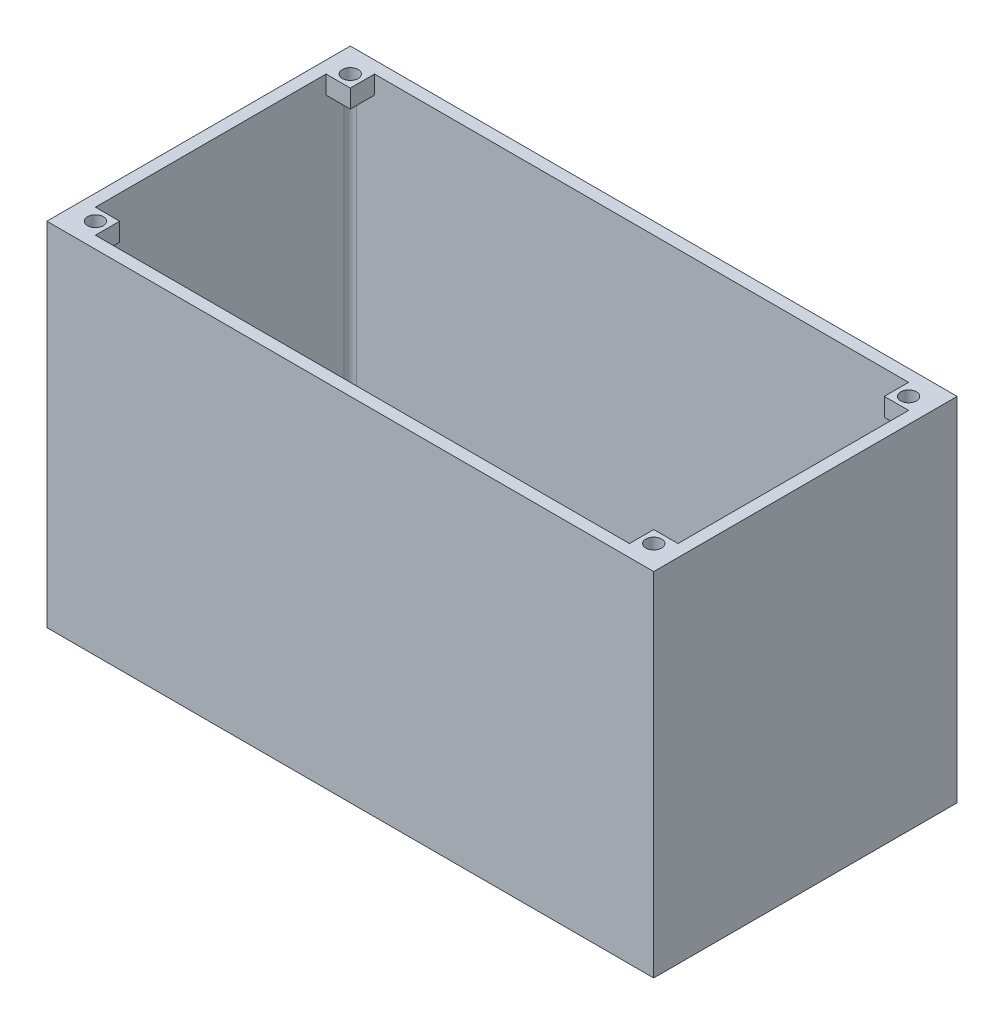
ISO-10303-21;
HEADER;
FILE_DESCRIPTION(('STEP AP214'),'2;1');
FILE_NAME('part.step','',(''),(''),'','','');
FILE_SCHEMA(('AUTOMOTIVE_DESIGN { 1 0 10303 214 1 1 1 1 }'));
ENDSEC;
DATA;
#1=APPLICATION_CONTEXT('core data for automotive mechanical design processes');
#2=APPLICATION_PROTOCOL_DEFINITION('international standard','automotive_design',2000,#1);
#3=PRODUCT_CONTEXT('',#1,'mechanical');
#4=PRODUCT('Part','Part','',(#3));
#5=PRODUCT_RELATED_PRODUCT_CATEGORY('part','',(#4));
#6=PRODUCT_DEFINITION_FORMATION('','',#4);
#7=PRODUCT_DEFINITION_CONTEXT('part definition',#1,'design');
#8=PRODUCT_DEFINITION('design','',#6,#7);
#9=PRODUCT_DEFINITION_SHAPE('','',#8);
#10=(LENGTH_UNIT() NAMED_UNIT(*) SI_UNIT(.MILLI.,.METRE.));
#11=(NAMED_UNIT(*) PLANE_ANGLE_UNIT() SI_UNIT($,.RADIAN.));
#12=(NAMED_UNIT(*) SI_UNIT($,.STERADIAN.) SOLID_ANGLE_UNIT());
#13=UNCERTAINTY_MEASURE_WITH_UNIT(LENGTH_MEASURE(1.E-05),#10,'distance_accuracy_value','');
#14=(GEOMETRIC_REPRESENTATION_CONTEXT(3) GLOBAL_UNCERTAINTY_ASSIGNED_CONTEXT((#13)) GLOBAL_UNIT_ASSIGNED_CONTEXT((#10,
#11,#12)) REPRESENTATION_CONTEXT('',''));
#15=CARTESIAN_POINT('',(0.,0.,0.));
#16=DIRECTION('',(0.,0.,1.));
#17=DIRECTION('',(1.,0.,0.));
#18=AXIS2_PLACEMENT_3D('',#15,#16,#17);
#19=CARTESIAN_POINT('',(0.,-2.53999999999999,-60.96));
#20=DIRECTION('',(0.,0.,-1.));
#21=DIRECTION('',(-1.,0.,0.));
#22=AXIS2_PLACEMENT_3D('',#19,#20,#21);
#23=PLANE('',#22);
#24=DIRECTION('',(0.,1.,0.));
#25=VECTOR('',#24,1.);
#26=CARTESIAN_POINT('',(7.62,-232.41,-60.96));
#27=LINE('',#26,#25);
#28=CARTESIAN_POINT('',(7.62,-232.41,-60.96));
#29=VERTEX_POINT('',#28);
#30=CARTESIAN_POINT('',(7.62,-228.6,-60.96));
#31=VERTEX_POINT('',#30);
#32=EDGE_CURVE('E240',#29,#31,#27,.T.);
#33=ORIENTED_EDGE('',*,*,#32,.F.);
#34=DIRECTION('',(1.,0.,0.));
#35=VECTOR('',#34,1.);
#36=CARTESIAN_POINT('',(0.,-232.41,-60.96));
#37=LINE('',#36,#35);
#38=CARTESIAN_POINT('',(3.81,-232.41,-60.96));
#39=VERTEX_POINT('',#38);
#40=EDGE_CURVE('E225',#39,#29,#37,.T.);
#41=ORIENTED_EDGE('',*,*,#40,.F.);
#42=DIRECTION('',(0.,-1.,0.));
#43=VECTOR('',#42,1.);
#44=CARTESIAN_POINT('',(3.81,-2.53999999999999,-60.96));
#45=LINE('',#44,#43);
#46=CARTESIAN_POINT('',(3.81,-302.26,-60.96));
#47=VERTEX_POINT('',#46);
#48=EDGE_CURVE('E452',#39,#47,#45,.T.);
#49=ORIENTED_EDGE('',*,*,#48,.T.);
#50=DIRECTION('',(1.,0.,0.));
#51=VECTOR('',#50,1.);
#52=CARTESIAN_POINT('',(0.,-302.26,-60.96));
#53=LINE('',#52,#51);
#54=CARTESIAN_POINT('',(123.19,-302.26,-60.96));
#55=VERTEX_POINT('',#54);
#56=EDGE_CURVE('E416',#47,#55,#53,.T.);
#57=ORIENTED_EDGE('',*,*,#56,.T.);
#58=DIRECTION('',(0.,-1.,0.));
#59=VECTOR('',#58,1.);
#60=CARTESIAN_POINT('',(123.19,-2.53999999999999,-60.96));
#61=LINE('',#60,#59);
#62=CARTESIAN_POINT('',(123.19,-232.41,-60.96));
#63=VERTEX_POINT('',#62);
#64=EDGE_CURVE('E72',#55,#63,#61,.F.);
#65=ORIENTED_EDGE('',*,*,#64,.T.);
#66=DIRECTION('',(1.,0.,0.));
#67=VECTOR('',#66,1.);
#68=CARTESIAN_POINT('',(0.,-232.41,-60.96));
#69=LINE('',#68,#67);
#70=CARTESIAN_POINT('',(119.38,-232.41,-60.96));
#71=VERTEX_POINT('',#70);
#72=EDGE_CURVE('E313',#71,#63,#69,.T.);
#73=ORIENTED_EDGE('',*,*,#72,.F.);
#74=DIRECTION('',(0.,1.,0.));
#75=VECTOR('',#74,1.);
#76=CARTESIAN_POINT('',(119.38,-232.41,-60.96));
#77=LINE('',#76,#75);
#78=CARTESIAN_POINT('',(119.38,-228.6,-60.96));
#79=VERTEX_POINT('',#78);
#80=EDGE_CURVE('E327',#71,#79,#77,.T.);
#81=ORIENTED_EDGE('',*,*,#80,.T.);
#82=DIRECTION('',(1.,0.,0.));
#83=VECTOR('',#82,1.);
#84=CARTESIAN_POINT('',(0.,-228.6,-60.96));
#85=LINE('',#84,#83);
#86=EDGE_CURVE('E248',#31,#79,#85,.T.);
#87=ORIENTED_EDGE('',*,*,#86,.F.);
#88=EDGE_LOOP('',(#33,#41,#49,#57,#65,#73,#81,#87));
#89=FACE_BOUND('',#88,.T.);
#90=ADVANCED_FACE('F63',(#89),#23,.F.);
#91=CARTESIAN_POINT('',(3.81,-2.53999999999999,-59.69));
#92=DIRECTION('',(0.,-1.,0.));
#93=DIRECTION('',(0.,0.,-1.));
#94=AXIS2_PLACEMENT_3D('',#91,#92,#93);
#95=CYLINDRICAL_SURFACE('',#94,1.27);
#96=CARTESIAN_POINT('',(3.81,-232.41,-59.69));
#97=DIRECTION('',(0.,1.,0.));
#98=DIRECTION('',(0.,0.,1.));
#99=AXIS2_PLACEMENT_3D('',#96,#97,#98);
#100=CIRCLE('',#99,1.27);
#101=CARTESIAN_POINT('',(2.54,-232.41,-59.69));
#102=VERTEX_POINT('',#101);
#103=EDGE_CURVE('E232',#102,#39,#100,.F.);
#104=ORIENTED_EDGE('',*,*,#103,.F.);
#105=DIRECTION('',(0.,-1.,0.));
#106=VECTOR('',#105,1.);
#107=CARTESIAN_POINT('',(2.54,-2.53999999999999,-59.69));
#108=LINE('',#107,#106);
#109=CARTESIAN_POINT('',(2.54,-302.26,-59.69));
#110=VERTEX_POINT('',#109);
#111=EDGE_CURVE('E466',#110,#102,#108,.F.);
#112=ORIENTED_EDGE('',*,*,#111,.F.);
#113=CARTESIAN_POINT('',(3.81,-302.26,-59.69));
#114=DIRECTION('',(0.,-1.,0.));
#115=DIRECTION('',(0.,0.,-1.));
#116=AXIS2_PLACEMENT_3D('',#113,#114,#115);
#117=CIRCLE('',#116,1.27);
#118=EDGE_CURVE('E470',#47,#110,#117,.F.);
#119=ORIENTED_EDGE('',*,*,#118,.F.);
#120=ORIENTED_EDGE('',*,*,#48,.F.);
#121=EDGE_LOOP('',(#104,#112,#119,#120));
#122=FACE_BOUND('',#121,.T.);
#123=ADVANCED_FACE('F553',(#122),#95,.F.);
#124=CARTESIAN_POINT('',(2.54,-2.53999999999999,0.));
#125=DIRECTION('',(1.,0.,0.));
#126=DIRECTION('',(0.,0.,-1.));
#127=AXIS2_PLACEMENT_3D('',#124,#125,#126);
#128=PLANE('',#127);
#129=DIRECTION('',(0.,1.,0.));
#130=VECTOR('',#129,1.);
#131=CARTESIAN_POINT('',(2.54,-232.41,-55.88));
#132=LINE('',#131,#130);
#133=CARTESIAN_POINT('',(2.54,-232.41,-55.88));
#134=VERTEX_POINT('',#133);
#135=CARTESIAN_POINT('',(2.54,-228.6,-55.88));
#136=VERTEX_POINT('',#135);
#137=EDGE_CURVE('E250',#134,#136,#132,.T.);
#138=ORIENTED_EDGE('',*,*,#137,.T.);
#139=DIRECTION('',(0.,0.,1.));
#140=VECTOR('',#139,1.);
#141=CARTESIAN_POINT('',(2.54,-228.6,0.));
#142=LINE('',#141,#140);
#143=CARTESIAN_POINT('',(2.54,-228.6,-7.62));
#144=VERTEX_POINT('',#143);
#145=EDGE_CURVE('E410',#136,#144,#142,.T.);
#146=ORIENTED_EDGE('',*,*,#145,.T.);
#147=DIRECTION('',(0.,1.,0.));
#148=VECTOR('',#147,1.);
#149=CARTESIAN_POINT('',(2.54,-232.41,-7.62));
#150=LINE('',#149,#148);
#151=CARTESIAN_POINT('',(2.54,-232.41,-7.62));
#152=VERTEX_POINT('',#151);
#153=EDGE_CURVE('E295',#152,#144,#150,.T.);
#154=ORIENTED_EDGE('',*,*,#153,.F.);
#155=DIRECTION('',(0.,0.,-1.));
#156=VECTOR('',#155,1.);
#157=CARTESIAN_POINT('',(2.54,-232.41,0.));
#158=LINE('',#157,#156);
#159=CARTESIAN_POINT('',(2.54,-232.41,-3.81));
#160=VERTEX_POINT('',#159);
#161=EDGE_CURVE('E275',#160,#152,#158,.T.);
#162=ORIENTED_EDGE('',*,*,#161,.F.);
#163=DIRECTION('',(0.,-1.,0.));
#164=VECTOR('',#163,1.);
#165=CARTESIAN_POINT('',(2.54,-302.26,-3.81));
#166=LINE('',#165,#164);
#167=CARTESIAN_POINT('',(2.54,-302.26,-3.81));
#168=VERTEX_POINT('',#167);
#169=EDGE_CURVE('E473',#160,#168,#166,.T.);
#170=ORIENTED_EDGE('',*,*,#169,.T.);
#171=DIRECTION('',(0.,0.,1.));
#172=VECTOR('',#171,1.);
#173=CARTESIAN_POINT('',(2.54,-302.26,0.));
#174=LINE('',#173,#172);
#175=EDGE_CURVE('E427',#110,#168,#174,.T.);
#176=ORIENTED_EDGE('',*,*,#175,.F.);
#177=ORIENTED_EDGE('',*,*,#111,.T.);
#178=DIRECTION('',(0.,0.,-1.));
#179=VECTOR('',#178,1.);
#180=CARTESIAN_POINT('',(2.54,-232.41,0.));
#181=LINE('',#180,#179);
#182=EDGE_CURVE('E257',#134,#102,#181,.T.);
#183=ORIENTED_EDGE('',*,*,#182,.F.);
#184=EDGE_LOOP('',(#138,#146,#154,#162,#170,#176,#177,#183));
#185=FACE_BOUND('',#184,.T.);
#186=ADVANCED_FACE('F545',(#185),#128,.T.);
#187=CARTESIAN_POINT('',(3.81,-2.53999999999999,-3.81));
#188=DIRECTION('',(0.,1.,0.));
#189=DIRECTION('',(0.,0.,1.));
#190=AXIS2_PLACEMENT_3D('',#187,#188,#189);
#191=CYLINDRICAL_SURFACE('',#190,1.27);
#192=CARTESIAN_POINT('',(3.81,-232.41,-3.81));
#193=DIRECTION('',(0.,1.,0.));
#194=DIRECTION('',(0.,0.,1.));
#195=AXIS2_PLACEMENT_3D('',#192,#193,#194);
#196=CIRCLE('',#195,1.27);
#197=CARTESIAN_POINT('',(3.81,-232.41,-2.54));
#198=VERTEX_POINT('',#197);
#199=EDGE_CURVE('E279',#198,#160,#196,.F.);
#200=ORIENTED_EDGE('',*,*,#199,.F.);
#201=DIRECTION('',(0.,-1.,0.));
#202=VECTOR('',#201,1.);
#203=CARTESIAN_POINT('',(3.81,-2.53999999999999,-2.54));
#204=LINE('',#203,#202);
#205=CARTESIAN_POINT('',(3.81,-302.26,-2.54));
#206=VERTEX_POINT('',#205);
#207=EDGE_CURVE('E476',#206,#198,#204,.F.);
#208=ORIENTED_EDGE('',*,*,#207,.F.);
#209=CARTESIAN_POINT('',(3.81,-302.26,-3.81));
#210=DIRECTION('',(0.,-1.,0.));
#211=DIRECTION('',(0.,0.,-1.));
#212=AXIS2_PLACEMENT_3D('',#209,#210,#211);
#213=CIRCLE('',#212,1.27);
#214=EDGE_CURVE('E479',#168,#206,#213,.F.);
#215=ORIENTED_EDGE('',*,*,#214,.F.);
#216=ORIENTED_EDGE('',*,*,#169,.F.);
#217=EDGE_LOOP('',(#200,#208,#215,#216));
#218=FACE_BOUND('',#217,.T.);
#219=ADVANCED_FACE('F574',(#218),#191,.F.);
#220=CARTESIAN_POINT('',(124.46,-2.53999999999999,0.));
#221=DIRECTION('',(1.,0.,0.));
#222=DIRECTION('',(0.,0.,-1.));
#223=AXIS2_PLACEMENT_3D('',#220,#221,#222);
#224=PLANE('',#223);
#225=DIRECTION('',(0.,1.,0.));
#226=VECTOR('',#225,1.);
#227=CARTESIAN_POINT('',(124.46,-232.41,-55.88));
#228=LINE('',#227,#226);
#229=CARTESIAN_POINT('',(124.46,-232.41,-55.88));
#230=VERTEX_POINT('',#229);
#231=CARTESIAN_POINT('',(124.46,-228.6,-55.88));
#232=VERTEX_POINT('',#231);
#233=EDGE_CURVE('E338',#230,#232,#228,.T.);
#234=ORIENTED_EDGE('',*,*,#233,.F.);
#235=DIRECTION('',(0.,0.,1.));
#236=VECTOR('',#235,1.);
#237=CARTESIAN_POINT('',(124.46,-232.41,0.));
#238=LINE('',#237,#236);
#239=CARTESIAN_POINT('',(124.46,-232.41,-59.69));
#240=VERTEX_POINT('',#239);
#241=EDGE_CURVE('E305',#240,#230,#238,.T.);
#242=ORIENTED_EDGE('',*,*,#241,.F.);
#243=DIRECTION('',(0.,-1.,0.));
#244=VECTOR('',#243,1.);
#245=CARTESIAN_POINT('',(124.46,-302.26,-59.69));
#246=LINE('',#245,#244);
#247=CARTESIAN_POINT('',(124.46,-302.26,-59.69));
#248=VERTEX_POINT('',#247);
#249=EDGE_CURVE('E493',#240,#248,#246,.T.);
#250=ORIENTED_EDGE('',*,*,#249,.T.);
#251=DIRECTION('',(0.,0.,1.));
#252=VECTOR('',#251,1.);
#253=CARTESIAN_POINT('',(124.46,-302.26,0.));
#254=LINE('',#253,#252);
#255=CARTESIAN_POINT('',(124.46,-302.26,-3.81));
#256=VERTEX_POINT('',#255);
#257=EDGE_CURVE('E420',#248,#256,#254,.T.);
#258=ORIENTED_EDGE('',*,*,#257,.T.);
#259=DIRECTION('',(0.,-1.,0.));
#260=VECTOR('',#259,1.);
#261=CARTESIAN_POINT('',(124.46,-2.53999999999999,-3.81));
#262=LINE('',#261,#260);
#263=CARTESIAN_POINT('',(124.46,-232.41,-3.81));
#264=VERTEX_POINT('',#263);
#265=EDGE_CURVE('E485',#256,#264,#262,.F.);
#266=ORIENTED_EDGE('',*,*,#265,.T.);
#267=DIRECTION('',(0.,0.,1.));
#268=VECTOR('',#267,1.);
#269=CARTESIAN_POINT('',(124.46,-232.41,0.));
#270=LINE('',#269,#268);
#271=CARTESIAN_POINT('',(124.46,-232.41,-7.62));
#272=VERTEX_POINT('',#271);
#273=EDGE_CURVE('E364',#272,#264,#270,.T.);
#274=ORIENTED_EDGE('',*,*,#273,.F.);
#275=DIRECTION('',(0.,1.,0.));
#276=VECTOR('',#275,1.);
#277=CARTESIAN_POINT('',(124.46,-232.41,-7.62));
#278=LINE('',#277,#276);
#279=CARTESIAN_POINT('',(124.46,-228.6,-7.62));
#280=VERTEX_POINT('',#279);
#281=EDGE_CURVE('E387',#272,#280,#278,.T.);
#282=ORIENTED_EDGE('',*,*,#281,.T.);
#283=DIRECTION('',(0.,0.,1.));
#284=VECTOR('',#283,1.);
#285=CARTESIAN_POINT('',(124.46,-228.6,0.));
#286=LINE('',#285,#284);
#287=EDGE_CURVE('E405',#232,#280,#286,.T.);
#288=ORIENTED_EDGE('',*,*,#287,.F.);
#289=EDGE_LOOP('',(#234,#242,#250,#258,#266,#274,#282,#288));
#290=FACE_BOUND('',#289,.T.);
#291=ADVANCED_FACE('F512',(#290),#224,.F.);
#292=CARTESIAN_POINT('',(123.19,-2.53999999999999,-59.69));
#293=DIRECTION('',(0.,1.,0.));
#294=DIRECTION('',(0.,0.,1.));
#295=AXIS2_PLACEMENT_3D('',#292,#293,#294);
#296=CYLINDRICAL_SURFACE('',#295,1.27);
#297=CARTESIAN_POINT('',(123.19,-232.41,-59.69));
#298=DIRECTION('',(0.,1.,0.));
#299=DIRECTION('',(0.,0.,1.));
#300=AXIS2_PLACEMENT_3D('',#297,#298,#299);
#301=CIRCLE('',#300,1.27);
#302=EDGE_CURVE('E309',#63,#240,#301,.F.);
#303=ORIENTED_EDGE('',*,*,#302,.F.);
#304=ORIENTED_EDGE('',*,*,#64,.F.);
#305=CARTESIAN_POINT('',(123.19,-302.26,-59.69));
#306=DIRECTION('',(0.,-1.,0.));
#307=DIRECTION('',(0.,0.,-1.));
#308=AXIS2_PLACEMENT_3D('',#305,#306,#307);
#309=CIRCLE('',#308,1.27);
#310=EDGE_CURVE('E12',#248,#55,#309,.F.);
#311=ORIENTED_EDGE('',*,*,#310,.F.);
#312=ORIENTED_EDGE('',*,*,#249,.F.);
#313=EDGE_LOOP('',(#303,#304,#311,#312));
#314=FACE_BOUND('',#313,.T.);
#315=ADVANCED_FACE('F65',(#314),#296,.F.);
#316=CARTESIAN_POINT('',(0.,-2.53999999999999,-2.54));
#317=DIRECTION('',(0.,0.,-1.));
#318=DIRECTION('',(-1.,0.,0.));
#319=AXIS2_PLACEMENT_3D('',#316,#317,#318);
#320=PLANE('',#319);
#321=DIRECTION('',(0.,1.,0.));
#322=VECTOR('',#321,1.);
#323=CARTESIAN_POINT('',(7.62,-232.41,-2.54));
#324=LINE('',#323,#322);
#325=CARTESIAN_POINT('',(7.62,-232.41,-2.54));
#326=VERTEX_POINT('',#325);
#327=CARTESIAN_POINT('',(7.62,-228.6,-2.54));
#328=VERTEX_POINT('',#327);
#329=EDGE_CURVE('E283',#326,#328,#324,.T.);
#330=ORIENTED_EDGE('',*,*,#329,.T.);
#331=DIRECTION('',(1.,0.,0.));
#332=VECTOR('',#331,1.);
#333=CARTESIAN_POINT('',(0.,-228.6,-2.54));
#334=LINE('',#333,#332);
#335=CARTESIAN_POINT('',(119.38,-228.6,-2.54));
#336=VERTEX_POINT('',#335);
#337=EDGE_CURVE('E413',#328,#336,#334,.T.);
#338=ORIENTED_EDGE('',*,*,#337,.T.);
#339=DIRECTION('',(0.,1.,0.));
#340=VECTOR('',#339,1.);
#341=CARTESIAN_POINT('',(119.38,-232.41,-2.54));
#342=LINE('',#341,#340);
#343=CARTESIAN_POINT('',(119.38,-232.41,-2.54));
#344=VERTEX_POINT('',#343);
#345=EDGE_CURVE('E372',#344,#336,#342,.T.);
#346=ORIENTED_EDGE('',*,*,#345,.F.);
#347=DIRECTION('',(-1.,0.,0.));
#348=VECTOR('',#347,1.);
#349=CARTESIAN_POINT('',(0.,-232.41,-2.54));
#350=LINE('',#349,#348);
#351=CARTESIAN_POINT('',(123.19,-232.41,-2.54));
#352=VERTEX_POINT('',#351);
#353=EDGE_CURVE('E356',#352,#344,#350,.T.);
#354=ORIENTED_EDGE('',*,*,#353,.F.);
#355=DIRECTION('',(0.,-1.,0.));
#356=VECTOR('',#355,1.);
#357=CARTESIAN_POINT('',(123.19,-2.53999999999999,-2.54));
#358=LINE('',#357,#356);
#359=CARTESIAN_POINT('',(123.19,-302.26,-2.54));
#360=VERTEX_POINT('',#359);
#361=EDGE_CURVE('E482',#352,#360,#358,.T.);
#362=ORIENTED_EDGE('',*,*,#361,.T.);
#363=DIRECTION('',(1.,0.,0.));
#364=VECTOR('',#363,1.);
#365=CARTESIAN_POINT('',(0.,-302.26,-2.54));
#366=LINE('',#365,#364);
#367=EDGE_CURVE('E423',#206,#360,#366,.T.);
#368=ORIENTED_EDGE('',*,*,#367,.F.);
#369=ORIENTED_EDGE('',*,*,#207,.T.);
#370=DIRECTION('',(-1.,0.,0.));
#371=VECTOR('',#370,1.);
#372=CARTESIAN_POINT('',(0.,-232.41,-2.54));
#373=LINE('',#372,#371);
#374=EDGE_CURVE('E87',#326,#198,#373,.T.);
#375=ORIENTED_EDGE('',*,*,#374,.F.);
#376=EDGE_LOOP('',(#330,#338,#346,#354,#362,#368,#369,#375));
#377=FACE_BOUND('',#376,.T.);
#378=ADVANCED_FACE('F570',(#377),#320,.T.);
#379=CARTESIAN_POINT('',(123.19,-2.53999999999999,-3.81));
#380=DIRECTION('',(0.,-1.,0.));
#381=DIRECTION('',(0.,0.,-1.));
#382=AXIS2_PLACEMENT_3D('',#379,#380,#381);
#383=CYLINDRICAL_SURFACE('',#382,1.27);
#384=CARTESIAN_POINT('',(123.19,-232.41,-3.81));
#385=DIRECTION('',(0.,1.,0.));
#386=DIRECTION('',(0.,0.,1.));
#387=AXIS2_PLACEMENT_3D('',#384,#385,#386);
#388=CIRCLE('',#387,1.27);
#389=EDGE_CURVE('E360',#264,#352,#388,.F.);
#390=ORIENTED_EDGE('',*,*,#389,.F.);
#391=ORIENTED_EDGE('',*,*,#265,.F.);
#392=CARTESIAN_POINT('',(123.19,-302.26,-3.81));
#393=DIRECTION('',(0.,-1.,0.));
#394=DIRECTION('',(0.,0.,-1.));
#395=AXIS2_PLACEMENT_3D('',#392,#393,#394);
#396=CIRCLE('',#395,1.27);
#397=EDGE_CURVE('E489',#360,#256,#396,.F.);
#398=ORIENTED_EDGE('',*,*,#397,.F.);
#399=ORIENTED_EDGE('',*,*,#361,.F.);
#400=EDGE_LOOP('',(#390,#391,#398,#399));
#401=FACE_BOUND('',#400,.T.);
#402=ADVANCED_FACE('F571',(#401),#383,.F.);
#403=CARTESIAN_POINT('',(0.,-302.26,0.));
#404=DIRECTION('',(-1.,0.,0.));
#405=DIRECTION('',(0.,0.,1.));
#406=AXIS2_PLACEMENT_3D('',#403,#404,#405);
#407=PLANE('',#406);
#408=DIRECTION('',(0.,1.,0.));
#409=VECTOR('',#408,1.);
#410=CARTESIAN_POINT('',(0.,-302.26,0.));
#411=LINE('',#410,#409);
#412=CARTESIAN_POINT('',(0.,-302.26,0.));
#413=VERTEX_POINT('',#412);
#414=CARTESIAN_POINT('',(0.,-228.6,0.));
#415=VERTEX_POINT('',#414);
#416=EDGE_CURVE('E447',#413,#415,#411,.T.);
#417=ORIENTED_EDGE('',*,*,#416,.T.);
#418=DIRECTION('',(0.,0.,1.));
#419=VECTOR('',#418,1.);
#420=CARTESIAN_POINT('',(0.,-228.6,-63.5));
#421=LINE('',#420,#419);
#422=CARTESIAN_POINT('',(0.,-228.6,-63.5));
#423=VERTEX_POINT('',#422);
#424=EDGE_CURVE('E386',#423,#415,#421,.T.);
#425=ORIENTED_EDGE('',*,*,#424,.F.);
#426=DIRECTION('',(0.,1.,0.));
#427=VECTOR('',#426,1.);
#428=CARTESIAN_POINT('',(0.,-302.26,-63.5));
#429=LINE('',#428,#427);
#430=CARTESIAN_POINT('',(0.,-302.26,-63.5));
#431=VERTEX_POINT('',#430);
#432=EDGE_CURVE('E448',#431,#423,#429,.T.);
#433=ORIENTED_EDGE('',*,*,#432,.F.);
#434=DIRECTION('',(0.,0.,1.));
#435=VECTOR('',#434,1.);
#436=CARTESIAN_POINT('',(0.,-302.26,0.));
#437=LINE('',#436,#435);
#438=EDGE_CURVE('E431',#431,#413,#437,.T.);
#439=ORIENTED_EDGE('',*,*,#438,.T.);
#440=EDGE_LOOP('',(#417,#425,#433,#439));
#441=FACE_BOUND('',#440,.T.);
#442=ADVANCED_FACE('F606',(#441),#407,.T.);
#443=CARTESIAN_POINT('',(0.,-302.26,-63.5));
#444=DIRECTION('',(0.,0.,-1.));
#445=DIRECTION('',(-1.,0.,0.));
#446=AXIS2_PLACEMENT_3D('',#443,#444,#445);
#447=PLANE('',#446);
#448=ORIENTED_EDGE('',*,*,#432,.T.);
#449=DIRECTION('',(-1.,0.,0.));
#450=VECTOR('',#449,1.);
#451=CARTESIAN_POINT('',(0.,-228.6,-63.5));
#452=LINE('',#451,#450);
#453=CARTESIAN_POINT('',(127.,-228.6,-63.5));
#454=VERTEX_POINT('',#453);
#455=EDGE_CURVE('E402',#454,#423,#452,.T.);
#456=ORIENTED_EDGE('',*,*,#455,.F.);
#457=DIRECTION('',(0.,1.,0.));
#458=VECTOR('',#457,1.);
#459=CARTESIAN_POINT('',(127.,-302.26,-63.5));
#460=LINE('',#459,#458);
#461=CARTESIAN_POINT('',(127.,-302.26,-63.5));
#462=VERTEX_POINT('',#461);
#463=EDGE_CURVE('E453',#462,#454,#460,.T.);
#464=ORIENTED_EDGE('',*,*,#463,.F.);
#465=DIRECTION('',(-1.,0.,0.));
#466=VECTOR('',#465,1.);
#467=CARTESIAN_POINT('',(0.,-302.26,-63.5));
#468=LINE('',#467,#466);
#469=EDGE_CURVE('E443',#462,#431,#468,.T.);
#470=ORIENTED_EDGE('',*,*,#469,.T.);
#471=EDGE_LOOP('',(#448,#456,#464,#470));
#472=FACE_BOUND('',#471,.T.);
#473=ADVANCED_FACE('F602',(#472),#447,.T.);
#474=CARTESIAN_POINT('',(127.,-302.26,0.));
#475=DIRECTION('',(1.,0.,0.));
#476=DIRECTION('',(0.,0.,-1.));
#477=AXIS2_PLACEMENT_3D('',#474,#475,#476);
#478=PLANE('',#477);
#479=ORIENTED_EDGE('',*,*,#463,.T.);
#480=DIRECTION('',(0.,0.,-1.));
#481=VECTOR('',#480,1.);
#482=CARTESIAN_POINT('',(127.,-228.6,-63.5));
#483=LINE('',#482,#481);
#484=CARTESIAN_POINT('',(127.,-228.6,0.));
#485=VERTEX_POINT('',#484);
#486=EDGE_CURVE('E399',#485,#454,#483,.T.);
#487=ORIENTED_EDGE('',*,*,#486,.F.);
#488=DIRECTION('',(0.,1.,0.));
#489=VECTOR('',#488,1.);
#490=CARTESIAN_POINT('',(127.,-302.26,0.));
#491=LINE('',#490,#489);
#492=CARTESIAN_POINT('',(127.,-302.26,0.));
#493=VERTEX_POINT('',#492);
#494=EDGE_CURVE('E457',#493,#485,#491,.T.);
#495=ORIENTED_EDGE('',*,*,#494,.F.);
#496=DIRECTION('',(0.,0.,-1.));
#497=VECTOR('',#496,1.);
#498=CARTESIAN_POINT('',(127.,-302.26,0.));
#499=LINE('',#498,#497);
#500=EDGE_CURVE('E439',#493,#462,#499,.T.);
#501=ORIENTED_EDGE('',*,*,#500,.T.);
#502=EDGE_LOOP('',(#479,#487,#495,#501));
#503=FACE_BOUND('',#502,.T.);
#504=ADVANCED_FACE('F605',(#503),#478,.T.);
#505=CARTESIAN_POINT('',(0.,-302.26,0.));
#506=DIRECTION('',(0.,0.,1.));
#507=DIRECTION('',(1.,0.,0.));
#508=AXIS2_PLACEMENT_3D('',#505,#506,#507);
#509=PLANE('',#508);
#510=ORIENTED_EDGE('',*,*,#494,.T.);
#511=DIRECTION('',(1.,0.,0.));
#512=VECTOR('',#511,1.);
#513=CARTESIAN_POINT('',(0.,-228.6,0.));
#514=LINE('',#513,#512);
#515=EDGE_CURVE('E396',#415,#485,#514,.T.);
#516=ORIENTED_EDGE('',*,*,#515,.F.);
#517=ORIENTED_EDGE('',*,*,#416,.F.);
#518=DIRECTION('',(1.,0.,0.));
#519=VECTOR('',#518,1.);
#520=CARTESIAN_POINT('',(0.,-302.26,0.));
#521=LINE('',#520,#519);
#522=EDGE_CURVE('E435',#413,#493,#521,.T.);
#523=ORIENTED_EDGE('',*,*,#522,.T.);
#524=EDGE_LOOP('',(#510,#516,#517,#523));
#525=FACE_BOUND('',#524,.T.);
#526=ADVANCED_FACE('F601',(#525),#509,.T.);
#527=CARTESIAN_POINT('',(0.,-302.26,0.));
#528=DIRECTION('',(0.,-1.,0.));
#529=DIRECTION('',(0.,0.,-1.));
#530=AXIS2_PLACEMENT_3D('',#527,#528,#529);
#531=PLANE('',#530);
#532=ORIENTED_EDGE('',*,*,#56,.F.);
#533=ORIENTED_EDGE('',*,*,#118,.T.);
#534=ORIENTED_EDGE('',*,*,#175,.T.);
#535=ORIENTED_EDGE('',*,*,#214,.T.);
#536=ORIENTED_EDGE('',*,*,#367,.T.);
#537=ORIENTED_EDGE('',*,*,#397,.T.);
#538=ORIENTED_EDGE('',*,*,#257,.F.);
#539=ORIENTED_EDGE('',*,*,#310,.T.);
#540=EDGE_LOOP('',(#532,#533,#534,#535,#536,#537,#538,#539));
#541=FACE_BOUND('',#540,.T.);
#542=ORIENTED_EDGE('',*,*,#438,.F.);
#543=ORIENTED_EDGE('',*,*,#469,.F.);
#544=ORIENTED_EDGE('',*,*,#500,.F.);
#545=ORIENTED_EDGE('',*,*,#522,.F.);
#546=EDGE_LOOP('',(#542,#543,#544,#545));
#547=FACE_BOUND('',#546,.T.);
#548=ADVANCED_FACE('F561',(#541,#547),#531,.T.);
#549=CARTESIAN_POINT('',(0.,-228.6,0.));
#550=DIRECTION('',(0.,1.,0.));
#551=DIRECTION('',(0.,0.,1.));
#552=AXIS2_PLACEMENT_3D('',#549,#550,#551);
#553=PLANE('',#552);
#554=ORIENTED_EDGE('',*,*,#145,.F.);
#555=DIRECTION('',(1.,0.,0.));
#556=VECTOR('',#555,1.);
#557=CARTESIAN_POINT('',(0.,-228.6,-55.88));
#558=LINE('',#557,#556);
#559=CARTESIAN_POINT('',(7.62,-228.6,-55.88));
#560=VERTEX_POINT('',#559);
#561=EDGE_CURVE('E543',#136,#560,#558,.T.);
#562=ORIENTED_EDGE('',*,*,#561,.T.);
#563=DIRECTION('',(0.,0.,1.));
#564=VECTOR('',#563,1.);
#565=CARTESIAN_POINT('',(7.62000000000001,-228.6,0.));
#566=LINE('',#565,#564);
#567=EDGE_CURVE('E79',#31,#560,#566,.T.);
#568=ORIENTED_EDGE('',*,*,#567,.F.);
#569=ORIENTED_EDGE('',*,*,#86,.T.);
#570=DIRECTION('',(0.,0.,1.));
#571=VECTOR('',#570,1.);
#572=CARTESIAN_POINT('',(119.38,-228.6,-3.2612801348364E-13));
#573=LINE('',#572,#571);
#574=CARTESIAN_POINT('',(119.38,-228.6,-55.88));
#575=VERTEX_POINT('',#574);
#576=EDGE_CURVE('E299',#79,#575,#573,.T.);
#577=ORIENTED_EDGE('',*,*,#576,.T.);
#578=DIRECTION('',(-1.,0.,0.));
#579=VECTOR('',#578,1.);
#580=CARTESIAN_POINT('',(0.,-228.6,-55.88));
#581=LINE('',#580,#579);
#582=EDGE_CURVE('E331',#232,#575,#581,.T.);
#583=ORIENTED_EDGE('',*,*,#582,.F.);
#584=ORIENTED_EDGE('',*,*,#287,.T.);
#585=DIRECTION('',(-1.,0.,0.));
#586=VECTOR('',#585,1.);
#587=CARTESIAN_POINT('',(0.,-228.6,-7.61999999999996));
#588=LINE('',#587,#586);
#589=CARTESIAN_POINT('',(119.38,-228.6,-7.62));
#590=VERTEX_POINT('',#589);
#591=EDGE_CURVE('E353',#280,#590,#588,.T.);
#592=ORIENTED_EDGE('',*,*,#591,.T.);
#593=DIRECTION('',(0.,0.,-1.));
#594=VECTOR('',#593,1.);
#595=CARTESIAN_POINT('',(119.38,-228.6,0.));
#596=LINE('',#595,#594);
#597=EDGE_CURVE('E376',#336,#590,#596,.T.);
#598=ORIENTED_EDGE('',*,*,#597,.F.);
#599=ORIENTED_EDGE('',*,*,#337,.F.);
#600=DIRECTION('',(0.,0.,-1.));
#601=VECTOR('',#600,1.);
#602=CARTESIAN_POINT('',(7.62,-228.6,0.));
#603=LINE('',#602,#601);
#604=CARTESIAN_POINT('',(7.62,-228.6,-7.62));
#605=VERTEX_POINT('',#604);
#606=EDGE_CURVE('E288',#328,#605,#603,.T.);
#607=ORIENTED_EDGE('',*,*,#606,.T.);
#608=DIRECTION('',(1.,0.,0.));
#609=VECTOR('',#608,1.);
#610=CARTESIAN_POINT('',(0.,-228.6,-7.62));
#611=LINE('',#610,#609);
#612=EDGE_CURVE('E265',#144,#605,#611,.T.);
#613=ORIENTED_EDGE('',*,*,#612,.F.);
#614=EDGE_LOOP('',(#554,#562,#568,#569,#577,#583,#584,#592,#598,#599,#607,#613));
#615=FACE_BOUND('',#614,.T.);
#616=ORIENTED_EDGE('',*,*,#424,.T.);
#617=ORIENTED_EDGE('',*,*,#515,.T.);
#618=ORIENTED_EDGE('',*,*,#486,.T.);
#619=ORIENTED_EDGE('',*,*,#455,.T.);
#620=EDGE_LOOP('',(#616,#617,#618,#619));
#621=FACE_BOUND('',#620,.T.);
#622=CARTESIAN_POINT('',(121.92,-228.6,-5.08));
#623=DIRECTION('',(0.,1.,0.));
#624=DIRECTION('',(0.,0.,1.));
#625=AXIS2_PLACEMENT_3D('',#622,#623,#624);
#626=CIRCLE('',#625,1.65100000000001);
#627=CARTESIAN_POINT('',(121.92,-228.6,-3.42899999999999));
#628=VERTEX_POINT('',#627);
#629=EDGE_CURVE('E342',#628,#628,#626,.T.);
#630=ORIENTED_EDGE('',*,*,#629,.F.);
#631=EDGE_LOOP('',(#630));
#632=FACE_BOUND('',#631,.T.);
#633=CARTESIAN_POINT('',(121.92,-228.6,-58.42));
#634=DIRECTION('',(0.,1.,0.));
#635=DIRECTION('',(0.,0.,1.));
#636=AXIS2_PLACEMENT_3D('',#633,#634,#635);
#637=CIRCLE('',#636,1.65100000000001);
#638=CARTESIAN_POINT('',(121.92,-228.6,-56.769));
#639=VERTEX_POINT('',#638);
#640=EDGE_CURVE('E310',#639,#639,#637,.T.);
#641=ORIENTED_EDGE('',*,*,#640,.F.);
#642=EDGE_LOOP('',(#641));
#643=FACE_BOUND('',#642,.T.);
#644=CARTESIAN_POINT('',(5.08,-228.6,-5.08));
#645=DIRECTION('',(0.,1.,0.));
#646=DIRECTION('',(0.,0.,1.));
#647=AXIS2_PLACEMENT_3D('',#644,#645,#646);
#648=CIRCLE('',#647,1.651);
#649=CARTESIAN_POINT('',(5.08,-228.6,-3.429));
#650=VERTEX_POINT('',#649);
#651=EDGE_CURVE('E284',#650,#650,#648,.T.);
#652=ORIENTED_EDGE('',*,*,#651,.F.);
#653=EDGE_LOOP('',(#652));
#654=FACE_BOUND('',#653,.T.);
#655=CARTESIAN_POINT('',(5.08,-228.6,-58.42));
#656=DIRECTION('',(0.,1.,0.));
#657=DIRECTION('',(0.,0.,1.));
#658=AXIS2_PLACEMENT_3D('',#655,#656,#657);
#659=CIRCLE('',#658,1.651);
#660=CARTESIAN_POINT('',(5.08,-228.6,-56.769));
#661=VERTEX_POINT('',#660);
#662=EDGE_CURVE('E931',#661,#661,#659,.T.);
#663=ORIENTED_EDGE('',*,*,#662,.F.);
#664=EDGE_LOOP('',(#663));
#665=FACE_BOUND('',#664,.T.);
#666=ADVANCED_FACE('F521',(#615,#621,#632,#643,#654,#665),#553,.T.);
#667=CARTESIAN_POINT('',(119.38,-232.41,0.));
#668=DIRECTION('',(1.,0.,0.));
#669=DIRECTION('',(0.,0.,-1.));
#670=AXIS2_PLACEMENT_3D('',#667,#668,#669);
#671=PLANE('',#670);
#672=ORIENTED_EDGE('',*,*,#597,.T.);
#673=DIRECTION('',(0.,1.,0.));
#674=VECTOR('',#673,1.);
#675=CARTESIAN_POINT('',(119.38,-232.41,-7.62));
#676=LINE('',#675,#674);
#677=CARTESIAN_POINT('',(119.38,-232.41,-7.62));
#678=VERTEX_POINT('',#677);
#679=EDGE_CURVE('E383',#678,#590,#676,.T.);
#680=ORIENTED_EDGE('',*,*,#679,.F.);
#681=DIRECTION('',(0.,0.,-1.));
#682=VECTOR('',#681,1.);
#683=CARTESIAN_POINT('',(119.38,-232.41,0.));
#684=LINE('',#683,#682);
#685=EDGE_CURVE('E352',#344,#678,#684,.T.);
#686=ORIENTED_EDGE('',*,*,#685,.F.);
#687=ORIENTED_EDGE('',*,*,#345,.T.);
#688=EDGE_LOOP('',(#672,#680,#686,#687));
#689=FACE_BOUND('',#688,.T.);
#690=ADVANCED_FACE('F532',(#689),#671,.F.);
#691=CARTESIAN_POINT('',(0.,-232.41,-7.61999999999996));
#692=DIRECTION('',(0.,0.,-1.));
#693=DIRECTION('',(-1.,0.,0.));
#694=AXIS2_PLACEMENT_3D('',#691,#692,#693);
#695=PLANE('',#694);
#696=ORIENTED_EDGE('',*,*,#591,.F.);
#697=ORIENTED_EDGE('',*,*,#281,.F.);
#698=DIRECTION('',(-1.,0.,0.));
#699=VECTOR('',#698,1.);
#700=CARTESIAN_POINT('',(0.,-232.41,-7.61999999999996));
#701=LINE('',#700,#699);
#702=EDGE_CURVE('E368',#272,#678,#701,.T.);
#703=ORIENTED_EDGE('',*,*,#702,.T.);
#704=ORIENTED_EDGE('',*,*,#679,.T.);
#705=EDGE_LOOP('',(#696,#697,#703,#704));
#706=FACE_BOUND('',#705,.T.);
#707=ADVANCED_FACE('F528',(#706),#695,.T.);
#708=CARTESIAN_POINT('',(121.92,-232.41,-5.08));
#709=DIRECTION('',(0.,1.,0.));
#710=DIRECTION('',(0.,0.,1.));
#711=AXIS2_PLACEMENT_3D('',#708,#709,#710);
#712=CYLINDRICAL_SURFACE('',#711,1.65100000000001);
#713=CARTESIAN_POINT('',(121.92,-232.41,-5.08));
#714=DIRECTION('',(0.,1.,0.));
#715=DIRECTION('',(0.,0.,1.));
#716=AXIS2_PLACEMENT_3D('',#713,#714,#715);
#717=CIRCLE('',#716,1.65100000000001);
#718=CARTESIAN_POINT('',(121.92,-232.41,-3.42899999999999));
#719=VERTEX_POINT('',#718);
#720=EDGE_CURVE('E348',#719,#719,#717,.T.);
#721=CARTESIAN_POINT('',(121.92,-232.41,-3.42899999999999));
#722=CARTESIAN_POINT('',(121.92,-232.3703125,-3.42899999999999));
#723=CARTESIAN_POINT('',(121.92,-232.330625,-3.42899999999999));
#724=CARTESIAN_POINT('',(121.92,-232.25125,-3.42899999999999));
#725=CARTESIAN_POINT('',(121.92,-232.2115625,-3.42899999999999));
#726=CARTESIAN_POINT('',(121.92,-232.1321875,-3.42899999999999));
#727=CARTESIAN_POINT('',(121.92,-232.0925,-3.42899999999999));
#728=CARTESIAN_POINT('',(121.92,-232.013125,-3.42899999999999));
#729=CARTESIAN_POINT('',(121.92,-231.9734375,-3.42899999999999));
#730=CARTESIAN_POINT('',(121.92,-231.8940625,-3.42899999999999));
#731=CARTESIAN_POINT('',(121.92,-231.854375,-3.42899999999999));
#732=CARTESIAN_POINT('',(121.92,-231.775,-3.42899999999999));
#733=CARTESIAN_POINT('',(121.92,-231.7353125,-3.42899999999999));
#734=CARTESIAN_POINT('',(121.92,-231.6559375,-3.42899999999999));
#735=CARTESIAN_POINT('',(121.92,-231.61625,-3.42899999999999));
#736=CARTESIAN_POINT('',(121.92,-231.536875,-3.42899999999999));
#737=CARTESIAN_POINT('',(121.92,-231.4971875,-3.42899999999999));
#738=CARTESIAN_POINT('',(121.92,-231.4178125,-3.42899999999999));
#739=CARTESIAN_POINT('',(121.92,-231.378125,-3.42899999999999));
#740=CARTESIAN_POINT('',(121.92,-231.29875,-3.42899999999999));
#741=CARTESIAN_POINT('',(121.92,-231.2590625,-3.42899999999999));
#742=CARTESIAN_POINT('',(121.92,-231.1796875,-3.42899999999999));
#743=CARTESIAN_POINT('',(121.92,-231.14,-3.42899999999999));
#744=CARTESIAN_POINT('',(121.92,-231.060625,-3.42899999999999));
#745=CARTESIAN_POINT('',(121.92,-231.0209375,-3.42899999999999));
#746=CARTESIAN_POINT('',(121.92,-230.9415625,-3.42899999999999));
#747=CARTESIAN_POINT('',(121.92,-230.901875,-3.42899999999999));
#748=CARTESIAN_POINT('',(121.92,-230.8225,-3.42899999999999));
#749=CARTESIAN_POINT('',(121.92,-230.7828125,-3.42899999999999));
#750=CARTESIAN_POINT('',(121.92,-230.7034375,-3.42899999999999));
#751=CARTESIAN_POINT('',(121.92,-230.66375,-3.42899999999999));
#752=CARTESIAN_POINT('',(121.92,-230.584375,-3.42899999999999));
#753=CARTESIAN_POINT('',(121.92,-230.5446875,-3.42899999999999));
#754=CARTESIAN_POINT('',(121.92,-230.4653125,-3.42899999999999));
#755=CARTESIAN_POINT('',(121.92,-230.425625,-3.42899999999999));
#756=CARTESIAN_POINT('',(121.92,-230.34625,-3.42899999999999));
#757=CARTESIAN_POINT('',(121.92,-230.3065625,-3.42899999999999));
#758=CARTESIAN_POINT('',(121.92,-230.2271875,-3.42899999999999));
#759=CARTESIAN_POINT('',(121.92,-230.1875,-3.42899999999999));
#760=CARTESIAN_POINT('',(121.92,-230.108125,-3.42899999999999));
#761=CARTESIAN_POINT('',(121.92,-230.0684375,-3.42899999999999));
#762=CARTESIAN_POINT('',(121.92,-229.9890625,-3.42899999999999));
#763=CARTESIAN_POINT('',(121.92,-229.949375,-3.42899999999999));
#764=CARTESIAN_POINT('',(121.92,-229.87,-3.42899999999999));
#765=CARTESIAN_POINT('',(121.92,-229.8303125,-3.42899999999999));
#766=CARTESIAN_POINT('',(121.92,-229.7509375,-3.42899999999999));
#767=CARTESIAN_POINT('',(121.92,-229.71125,-3.42899999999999));
#768=CARTESIAN_POINT('',(121.92,-229.631875,-3.42899999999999));
#769=CARTESIAN_POINT('',(121.92,-229.5921875,-3.42899999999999));
#770=CARTESIAN_POINT('',(121.92,-229.5128125,-3.42899999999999));
#771=CARTESIAN_POINT('',(121.92,-229.473125,-3.42899999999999));
#772=CARTESIAN_POINT('',(121.92,-229.39375,-3.42899999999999));
#773=CARTESIAN_POINT('',(121.92,-229.3540625,-3.42899999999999));
#774=CARTESIAN_POINT('',(121.92,-229.2746875,-3.42899999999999));
#775=CARTESIAN_POINT('',(121.92,-229.235,-3.42899999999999));
#776=CARTESIAN_POINT('',(121.92,-229.155625,-3.42899999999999));
#777=CARTESIAN_POINT('',(121.92,-229.1159375,-3.42899999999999));
#778=CARTESIAN_POINT('',(121.92,-229.0365625,-3.42899999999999));
#779=CARTESIAN_POINT('',(121.92,-228.996875,-3.42899999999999));
#780=CARTESIAN_POINT('',(121.92,-228.9175,-3.42899999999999));
#781=CARTESIAN_POINT('',(121.92,-228.8778125,-3.42899999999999));
#782=CARTESIAN_POINT('',(121.92,-228.7984375,-3.42899999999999));
#783=CARTESIAN_POINT('',(121.92,-228.75875,-3.42899999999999));
#784=CARTESIAN_POINT('',(121.92,-228.679375,-3.42899999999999));
#785=CARTESIAN_POINT('',(121.92,-228.6396875,-3.42899999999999));
#786=CARTESIAN_POINT('',(121.92,-228.6,-3.42899999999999));
#787=B_SPLINE_CURVE_WITH_KNOTS('',3,(#721,#722,#723,#724,#725,#726,#727,#728,#729,#730,#731,
#732,#733,#734,#735,#736,#737,#738,#739,#740,#741,#742,#743,#744,#745,#746,#747,#748,#749,#750,
#751,#752,#753,#754,#755,#756,#757,#758,#759,#760,#761,#762,#763,#764,#765,#766,#767,#768,#769,
#770,#771,#772,#773,#774,#775,#776,#777,#778,#779,#780,#781,#782,#783,#784,#785,#786),
.UNSPECIFIED.,.F.,.F.,(4,2,2,2,2,2,2,2,2,2,2,2,2,2,2,2,2,2,2,2,2,2,2,2,2,2,2,2,2,2,2,2,4),(0.,
0.119062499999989,0.238124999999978,0.357187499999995,0.476249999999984,0.5953125,
0.714374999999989,0.833437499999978,0.952499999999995,1.07156249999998,1.190625,
1.30968749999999,1.42874999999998,1.5478125,1.66687499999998,1.7859375,1.90499999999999,
2.02406249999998,2.143125,2.26218749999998,2.38125,2.50031249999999,2.61937499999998,2.7384375,
2.85749999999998,2.9765625,3.09562499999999,3.21468749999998,3.33375,3.45281249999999,3.571875,
3.69093749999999,3.81000000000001),.UNSPECIFIED.);
#788=EDGE_CURVE('BSEAM630',#719,#628,#787,.T.);
#789=ORIENTED_EDGE('',*,*,#720,.F.);
#790=ORIENTED_EDGE('',*,*,#629,.T.);
#791=ORIENTED_EDGE('',*,*,#788,.T.);
#792=ORIENTED_EDGE('',*,*,#788,.F.);
#793=EDGE_LOOP('',(#789,#791,#790,#792));
#794=FACE_BOUND('',#793,.T.);
#795=ADVANCED_FACE('F630',(#794),#712,.F.);
#796=CARTESIAN_POINT('',(0.,-232.41,0.));
#797=DIRECTION('',(0.,1.,0.));
#798=DIRECTION('',(0.,0.,1.));
#799=AXIS2_PLACEMENT_3D('',#796,#797,#798);
#800=PLANE('',#799);
#801=ORIENTED_EDGE('',*,*,#720,.T.);
#802=EDGE_LOOP('',(#801));
#803=FACE_BOUND('',#802,.T.);
#804=ORIENTED_EDGE('',*,*,#685,.T.);
#805=ORIENTED_EDGE('',*,*,#702,.F.);
#806=ORIENTED_EDGE('',*,*,#273,.T.);
#807=ORIENTED_EDGE('',*,*,#389,.T.);
#808=ORIENTED_EDGE('',*,*,#353,.T.);
#809=EDGE_LOOP('',(#804,#805,#806,#807,#808));
#810=FACE_BOUND('',#809,.T.);
#811=ADVANCED_FACE('F568',(#803,#810),#800,.F.);
#812=CARTESIAN_POINT('',(0.,-232.41,-55.88));
#813=DIRECTION('',(0.,0.,-1.));
#814=DIRECTION('',(-1.,0.,0.));
#815=AXIS2_PLACEMENT_3D('',#812,#813,#814);
#816=PLANE('',#815);
#817=ORIENTED_EDGE('',*,*,#582,.T.);
#818=DIRECTION('',(0.,1.,0.));
#819=VECTOR('',#818,1.);
#820=CARTESIAN_POINT('',(119.38,-232.41,-55.88));
#821=LINE('',#820,#819);
#822=CARTESIAN_POINT('',(119.38,-232.41,-55.88));
#823=VERTEX_POINT('',#822);
#824=EDGE_CURVE('E343',#823,#575,#821,.T.);
#825=ORIENTED_EDGE('',*,*,#824,.F.);
#826=DIRECTION('',(-1.,0.,0.));
#827=VECTOR('',#826,1.);
#828=CARTESIAN_POINT('',(0.,-232.41,-55.88));
#829=LINE('',#828,#827);
#830=EDGE_CURVE('E320',#230,#823,#829,.T.);
#831=ORIENTED_EDGE('',*,*,#830,.F.);
#832=ORIENTED_EDGE('',*,*,#233,.T.);
#833=EDGE_LOOP('',(#817,#825,#831,#832));
#834=FACE_BOUND('',#833,.T.);
#835=ADVANCED_FACE('F515',(#834),#816,.F.);
#836=CARTESIAN_POINT('',(119.38,-232.41,-3.2612801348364E-13));
#837=DIRECTION('',(-1.,0.,0.));
#838=DIRECTION('',(0.,0.,1.));
#839=AXIS2_PLACEMENT_3D('',#836,#837,#838);
#840=PLANE('',#839);
#841=ORIENTED_EDGE('',*,*,#576,.F.);
#842=ORIENTED_EDGE('',*,*,#80,.F.);
#843=DIRECTION('',(0.,0.,1.));
#844=VECTOR('',#843,1.);
#845=CARTESIAN_POINT('',(119.38,-232.41,-3.2612801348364E-13));
#846=LINE('',#845,#844);
#847=EDGE_CURVE('E316',#71,#823,#846,.T.);
#848=ORIENTED_EDGE('',*,*,#847,.T.);
#849=ORIENTED_EDGE('',*,*,#824,.T.);
#850=EDGE_LOOP('',(#841,#842,#848,#849));
#851=FACE_BOUND('',#850,.T.);
#852=ADVANCED_FACE('F519',(#851),#840,.T.);
#853=CARTESIAN_POINT('',(121.92,-232.41,-58.42));
#854=DIRECTION('',(0.,1.,0.));
#855=DIRECTION('',(0.,0.,1.));
#856=AXIS2_PLACEMENT_3D('',#853,#854,#855);
#857=CYLINDRICAL_SURFACE('',#856,1.65100000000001);
#858=CARTESIAN_POINT('',(121.92,-232.41,-58.42));
#859=DIRECTION('',(0.,1.,0.));
#860=DIRECTION('',(0.,0.,1.));
#861=AXIS2_PLACEMENT_3D('',#858,#859,#860);
#862=CIRCLE('',#861,1.65100000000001);
#863=CARTESIAN_POINT('',(121.92,-232.41,-56.769));
#864=VERTEX_POINT('',#863);
#865=EDGE_CURVE('E323',#864,#864,#862,.T.);
#866=CARTESIAN_POINT('',(121.92,-232.41,-56.769));
#867=CARTESIAN_POINT('',(121.92,-232.3703125,-56.769));
#868=CARTESIAN_POINT('',(121.92,-232.330625,-56.769));
#869=CARTESIAN_POINT('',(121.92,-232.25125,-56.769));
#870=CARTESIAN_POINT('',(121.92,-232.2115625,-56.769));
#871=CARTESIAN_POINT('',(121.92,-232.1321875,-56.769));
#872=CARTESIAN_POINT('',(121.92,-232.0925,-56.769));
#873=CARTESIAN_POINT('',(121.92,-232.013125,-56.769));
#874=CARTESIAN_POINT('',(121.92,-231.9734375,-56.769));
#875=CARTESIAN_POINT('',(121.92,-231.8940625,-56.769));
#876=CARTESIAN_POINT('',(121.92,-231.854375,-56.769));
#877=CARTESIAN_POINT('',(121.92,-231.775,-56.769));
#878=CARTESIAN_POINT('',(121.92,-231.7353125,-56.769));
#879=CARTESIAN_POINT('',(121.92,-231.6559375,-56.769));
#880=CARTESIAN_POINT('',(121.92,-231.61625,-56.769));
#881=CARTESIAN_POINT('',(121.92,-231.536875,-56.769));
#882=CARTESIAN_POINT('',(121.92,-231.4971875,-56.769));
#883=CARTESIAN_POINT('',(121.92,-231.4178125,-56.769));
#884=CARTESIAN_POINT('',(121.92,-231.378125,-56.769));
#885=CARTESIAN_POINT('',(121.92,-231.29875,-56.769));
#886=CARTESIAN_POINT('',(121.92,-231.2590625,-56.769));
#887=CARTESIAN_POINT('',(121.92,-231.1796875,-56.769));
#888=CARTESIAN_POINT('',(121.92,-231.14,-56.769));
#889=CARTESIAN_POINT('',(121.92,-231.060625,-56.769));
#890=CARTESIAN_POINT('',(121.92,-231.0209375,-56.769));
#891=CARTESIAN_POINT('',(121.92,-230.9415625,-56.769));
#892=CARTESIAN_POINT('',(121.92,-230.901875,-56.769));
#893=CARTESIAN_POINT('',(121.92,-230.8225,-56.769));
#894=CARTESIAN_POINT('',(121.92,-230.7828125,-56.769));
#895=CARTESIAN_POINT('',(121.92,-230.7034375,-56.769));
#896=CARTESIAN_POINT('',(121.92,-230.66375,-56.769));
#897=CARTESIAN_POINT('',(121.92,-230.584375,-56.769));
#898=CARTESIAN_POINT('',(121.92,-230.5446875,-56.769));
#899=CARTESIAN_POINT('',(121.92,-230.4653125,-56.769));
#900=CARTESIAN_POINT('',(121.92,-230.425625,-56.769));
#901=CARTESIAN_POINT('',(121.92,-230.34625,-56.769));
#902=CARTESIAN_POINT('',(121.92,-230.3065625,-56.769));
#903=CARTESIAN_POINT('',(121.92,-230.2271875,-56.769));
#904=CARTESIAN_POINT('',(121.92,-230.1875,-56.769));
#905=CARTESIAN_POINT('',(121.92,-230.108125,-56.769));
#906=CARTESIAN_POINT('',(121.92,-230.0684375,-56.769));
#907=CARTESIAN_POINT('',(121.92,-229.9890625,-56.769));
#908=CARTESIAN_POINT('',(121.92,-229.949375,-56.769));
#909=CARTESIAN_POINT('',(121.92,-229.87,-56.769));
#910=CARTESIAN_POINT('',(121.92,-229.8303125,-56.769));
#911=CARTESIAN_POINT('',(121.92,-229.7509375,-56.769));
#912=CARTESIAN_POINT('',(121.92,-229.71125,-56.769));
#913=CARTESIAN_POINT('',(121.92,-229.631875,-56.769));
#914=CARTESIAN_POINT('',(121.92,-229.5921875,-56.769));
#915=CARTESIAN_POINT('',(121.92,-229.5128125,-56.769));
#916=CARTESIAN_POINT('',(121.92,-229.473125,-56.769));
#917=CARTESIAN_POINT('',(121.92,-229.39375,-56.769));
#918=CARTESIAN_POINT('',(121.92,-229.3540625,-56.769));
#919=CARTESIAN_POINT('',(121.92,-229.2746875,-56.769));
#920=CARTESIAN_POINT('',(121.92,-229.235,-56.769));
#921=CARTESIAN_POINT('',(121.92,-229.155625,-56.769));
#922=CARTESIAN_POINT('',(121.92,-229.1159375,-56.769));
#923=CARTESIAN_POINT('',(121.92,-229.0365625,-56.769));
#924=CARTESIAN_POINT('',(121.92,-228.996875,-56.769));
#925=CARTESIAN_POINT('',(121.92,-228.9175,-56.769));
#926=CARTESIAN_POINT('',(121.92,-228.8778125,-56.769));
#927=CARTESIAN_POINT('',(121.92,-228.7984375,-56.769));
#928=CARTESIAN_POINT('',(121.92,-228.75875,-56.769));
#929=CARTESIAN_POINT('',(121.92,-228.679375,-56.769));
#930=CARTESIAN_POINT('',(121.92,-228.6396875,-56.769));
#931=CARTESIAN_POINT('',(121.92,-228.6,-56.769));
#932=B_SPLINE_CURVE_WITH_KNOTS('',3,(#866,#867,#868,#869,#870,#871,#872,#873,#874,#875,#876,
#877,#878,#879,#880,#881,#882,#883,#884,#885,#886,#887,#888,#889,#890,#891,#892,#893,#894,#895,
#896,#897,#898,#899,#900,#901,#902,#903,#904,#905,#906,#907,#908,#909,#910,#911,#912,#913,#914,
#915,#916,#917,#918,#919,#920,#921,#922,#923,#924,#925,#926,#927,#928,#929,#930,#931),
.UNSPECIFIED.,.F.,.F.,(4,2,2,2,2,2,2,2,2,2,2,2,2,2,2,2,2,2,2,2,2,2,2,2,2,2,2,2,2,2,2,2,4),(0.,
0.119062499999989,0.238124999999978,0.357187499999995,0.476249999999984,0.5953125,
0.714374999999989,0.833437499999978,0.952499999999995,1.07156249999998,1.190625,
1.30968749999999,1.42874999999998,1.5478125,1.66687499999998,1.7859375,1.90499999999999,
2.02406249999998,2.143125,2.26218749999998,2.38125,2.50031249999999,2.61937499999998,2.7384375,
2.85749999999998,2.9765625,3.09562499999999,3.21468749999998,3.33375,3.45281249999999,3.571875,
3.69093749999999,3.81000000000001),.UNSPECIFIED.);
#933=EDGE_CURVE('BSEAM643',#864,#639,#932,.T.);
#934=ORIENTED_EDGE('',*,*,#865,.F.);
#935=ORIENTED_EDGE('',*,*,#640,.T.);
#936=ORIENTED_EDGE('',*,*,#933,.T.);
#937=ORIENTED_EDGE('',*,*,#933,.F.);
#938=EDGE_LOOP('',(#934,#936,#935,#937));
#939=FACE_BOUND('',#938,.T.);
#940=ADVANCED_FACE('F643',(#939),#857,.F.);
#941=CARTESIAN_POINT('',(0.,-232.41,0.));
#942=DIRECTION('',(0.,1.,0.));
#943=DIRECTION('',(0.,0.,1.));
#944=AXIS2_PLACEMENT_3D('',#941,#942,#943);
#945=PLANE('',#944);
#946=ORIENTED_EDGE('',*,*,#241,.T.);
#947=ORIENTED_EDGE('',*,*,#830,.T.);
#948=ORIENTED_EDGE('',*,*,#847,.F.);
#949=ORIENTED_EDGE('',*,*,#72,.T.);
#950=ORIENTED_EDGE('',*,*,#302,.T.);
#951=EDGE_LOOP('',(#946,#947,#948,#949,#950));
#952=FACE_BOUND('',#951,.T.);
#953=ORIENTED_EDGE('',*,*,#865,.T.);
#954=EDGE_LOOP('',(#953));
#955=FACE_BOUND('',#954,.T.);
#956=ADVANCED_FACE('F507',(#952,#955),#945,.F.);
#957=CARTESIAN_POINT('',(0.,-232.41,-7.62));
#958=DIRECTION('',(0.,0.,1.));
#959=DIRECTION('',(1.,0.,0.));
#960=AXIS2_PLACEMENT_3D('',#957,#958,#959);
#961=PLANE('',#960);
#962=ORIENTED_EDGE('',*,*,#612,.T.);
#963=DIRECTION('',(0.,1.,0.));
#964=VECTOR('',#963,1.);
#965=CARTESIAN_POINT('',(7.62,-232.41,-7.62));
#966=LINE('',#965,#964);
#967=CARTESIAN_POINT('',(7.62,-232.41,-7.62));
#968=VERTEX_POINT('',#967);
#969=EDGE_CURVE('E300',#968,#605,#966,.T.);
#970=ORIENTED_EDGE('',*,*,#969,.F.);
#971=DIRECTION('',(1.,0.,0.));
#972=VECTOR('',#971,1.);
#973=CARTESIAN_POINT('',(0.,-232.41,-7.62));
#974=LINE('',#973,#972);
#975=EDGE_CURVE('E272',#152,#968,#974,.T.);
#976=ORIENTED_EDGE('',*,*,#975,.F.);
#977=ORIENTED_EDGE('',*,*,#153,.T.);
#978=EDGE_LOOP('',(#962,#970,#976,#977));
#979=FACE_BOUND('',#978,.T.);
#980=ADVANCED_FACE('F542',(#979),#961,.F.);
#981=CARTESIAN_POINT('',(5.08,-232.41,-5.08));
#982=DIRECTION('',(0.,1.,0.));
#983=DIRECTION('',(0.,0.,1.));
#984=AXIS2_PLACEMENT_3D('',#981,#982,#983);
#985=CYLINDRICAL_SURFACE('',#984,1.651);
#986=CARTESIAN_POINT('',(5.08,-232.41,-5.08));
#987=DIRECTION('',(0.,1.,0.));
#988=DIRECTION('',(0.,0.,1.));
#989=AXIS2_PLACEMENT_3D('',#986,#987,#988);
#990=CIRCLE('',#989,1.651);
#991=CARTESIAN_POINT('',(5.08,-232.41,-3.429));
#992=VERTEX_POINT('',#991);
#993=EDGE_CURVE('E261',#992,#992,#990,.T.);
#994=CARTESIAN_POINT('',(5.08,-232.41,-3.429));
#995=CARTESIAN_POINT('',(5.08,-232.3703125,-3.429));
#996=CARTESIAN_POINT('',(5.08,-232.330625,-3.429));
#997=CARTESIAN_POINT('',(5.08,-232.25125,-3.429));
#998=CARTESIAN_POINT('',(5.08,-232.2115625,-3.429));
#999=CARTESIAN_POINT('',(5.08,-232.1321875,-3.429));
#1000=CARTESIAN_POINT('',(5.08,-232.0925,-3.429));
#1001=CARTESIAN_POINT('',(5.08,-232.013125,-3.429));
#1002=CARTESIAN_POINT('',(5.08,-231.9734375,-3.429));
#1003=CARTESIAN_POINT('',(5.08,-231.8940625,-3.429));
#1004=CARTESIAN_POINT('',(5.08,-231.854375,-3.429));
#1005=CARTESIAN_POINT('',(5.08,-231.775,-3.429));
#1006=CARTESIAN_POINT('',(5.08,-231.7353125,-3.429));
#1007=CARTESIAN_POINT('',(5.08,-231.6559375,-3.429));
#1008=CARTESIAN_POINT('',(5.08,-231.61625,-3.429));
#1009=CARTESIAN_POINT('',(5.08,-231.536875,-3.429));
#1010=CARTESIAN_POINT('',(5.08,-231.4971875,-3.429));
#1011=CARTESIAN_POINT('',(5.08,-231.4178125,-3.429));
#1012=CARTESIAN_POINT('',(5.08,-231.378125,-3.429));
#1013=CARTESIAN_POINT('',(5.08,-231.29875,-3.429));
#1014=CARTESIAN_POINT('',(5.08,-231.2590625,-3.429));
#1015=CARTESIAN_POINT('',(5.08,-231.1796875,-3.429));
#1016=CARTESIAN_POINT('',(5.08,-231.14,-3.429));
#1017=CARTESIAN_POINT('',(5.08,-231.060625,-3.429));
#1018=CARTESIAN_POINT('',(5.08,-231.0209375,-3.429));
#1019=CARTESIAN_POINT('',(5.08,-230.9415625,-3.429));
#1020=CARTESIAN_POINT('',(5.08,-230.901875,-3.429));
#1021=CARTESIAN_POINT('',(5.08,-230.8225,-3.429));
#1022=CARTESIAN_POINT('',(5.08,-230.7828125,-3.429));
#1023=CARTESIAN_POINT('',(5.08,-230.7034375,-3.429));
#1024=CARTESIAN_POINT('',(5.08,-230.66375,-3.429));
#1025=CARTESIAN_POINT('',(5.08,-230.584375,-3.429));
#1026=CARTESIAN_POINT('',(5.08,-230.5446875,-3.429));
#1027=CARTESIAN_POINT('',(5.08,-230.4653125,-3.429));
#1028=CARTESIAN_POINT('',(5.08,-230.425625,-3.429));
#1029=CARTESIAN_POINT('',(5.08,-230.34625,-3.429));
#1030=CARTESIAN_POINT('',(5.08,-230.3065625,-3.429));
#1031=CARTESIAN_POINT('',(5.08,-230.2271875,-3.429));
#1032=CARTESIAN_POINT('',(5.08,-230.1875,-3.429));
#1033=CARTESIAN_POINT('',(5.08,-230.108125,-3.429));
#1034=CARTESIAN_POINT('',(5.08,-230.0684375,-3.429));
#1035=CARTESIAN_POINT('',(5.08,-229.9890625,-3.429));
#1036=CARTESIAN_POINT('',(5.08,-229.949375,-3.429));
#1037=CARTESIAN_POINT('',(5.08,-229.87,-3.429));
#1038=CARTESIAN_POINT('',(5.08,-229.8303125,-3.429));
#1039=CARTESIAN_POINT('',(5.08,-229.7509375,-3.429));
#1040=CARTESIAN_POINT('',(5.08,-229.71125,-3.429));
#1041=CARTESIAN_POINT('',(5.08,-229.631875,-3.429));
#1042=CARTESIAN_POINT('',(5.08,-229.5921875,-3.429));
#1043=CARTESIAN_POINT('',(5.08,-229.5128125,-3.429));
#1044=CARTESIAN_POINT('',(5.08,-229.473125,-3.429));
#1045=CARTESIAN_POINT('',(5.08,-229.39375,-3.429));
#1046=CARTESIAN_POINT('',(5.08,-229.3540625,-3.429));
#1047=CARTESIAN_POINT('',(5.08,-229.2746875,-3.429));
#1048=CARTESIAN_POINT('',(5.08,-229.235,-3.429));
#1049=CARTESIAN_POINT('',(5.08,-229.155625,-3.429));
#1050=CARTESIAN_POINT('',(5.08,-229.1159375,-3.429));
#1051=CARTESIAN_POINT('',(5.08,-229.0365625,-3.429));
#1052=CARTESIAN_POINT('',(5.08,-228.996875,-3.429));
#1053=CARTESIAN_POINT('',(5.08,-228.9175,-3.429));
#1054=CARTESIAN_POINT('',(5.08,-228.8778125,-3.429));
#1055=CARTESIAN_POINT('',(5.08,-228.7984375,-3.429));
#1056=CARTESIAN_POINT('',(5.08,-228.75875,-3.429));
#1057=CARTESIAN_POINT('',(5.08,-228.679375,-3.429));
#1058=CARTESIAN_POINT('',(5.08,-228.6396875,-3.429));
#1059=CARTESIAN_POINT('',(5.08,-228.6,-3.429));
#1060=B_SPLINE_CURVE_WITH_KNOTS('',3,(#994,#995,#996,#997,#998,#999,#1000,#1001,#1002,#1003,
#1004,#1005,#1006,#1007,#1008,#1009,#1010,#1011,#1012,#1013,#1014,#1015,#1016,#1017,#1018,#1019,
#1020,#1021,#1022,#1023,#1024,#1025,#1026,#1027,#1028,#1029,#1030,#1031,#1032,#1033,#1034,#1035,
#1036,#1037,#1038,#1039,#1040,#1041,#1042,#1043,#1044,#1045,#1046,#1047,#1048,#1049,#1050,#1051,
#1052,#1053,#1054,#1055,#1056,#1057,#1058,#1059),.UNSPECIFIED.,.F.,.F.,(4,2,2,2,2,2,2,2,2,2,2,2,
2,2,2,2,2,2,2,2,2,2,2,2,2,2,2,2,2,2,2,2,4),(0.,0.119062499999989,0.238124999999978,
0.357187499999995,0.476249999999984,0.5953125,0.714374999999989,0.833437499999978,
0.952499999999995,1.07156249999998,1.190625,1.30968749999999,1.42874999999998,1.5478125,
1.66687499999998,1.7859375,1.90499999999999,2.02406249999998,2.143125,2.26218749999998,2.38125,
2.50031249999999,2.61937499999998,2.7384375,2.85749999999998,2.9765625,3.09562499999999,
3.21468749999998,3.33375,3.45281249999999,3.571875,3.69093749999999,3.81000000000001),.UNSPECIFIED.);
#1061=EDGE_CURVE('BSEAM585',#992,#650,#1060,.T.);
#1062=ORIENTED_EDGE('',*,*,#993,.F.);
#1063=ORIENTED_EDGE('',*,*,#651,.T.);
#1064=ORIENTED_EDGE('',*,*,#1061,.T.);
#1065=ORIENTED_EDGE('',*,*,#1061,.F.);
#1066=EDGE_LOOP('',(#1062,#1064,#1063,#1065));
#1067=FACE_BOUND('',#1066,.T.);
#1068=ADVANCED_FACE('F585',(#1067),#985,.F.);
#1069=CARTESIAN_POINT('',(7.62,-232.41,0.));
#1070=DIRECTION('',(1.,0.,0.));
#1071=DIRECTION('',(0.,0.,-1.));
#1072=AXIS2_PLACEMENT_3D('',#1069,#1070,#1071);
#1073=PLANE('',#1072);
#1074=ORIENTED_EDGE('',*,*,#606,.F.);
#1075=ORIENTED_EDGE('',*,*,#329,.F.);
#1076=DIRECTION('',(0.,0.,-1.));
#1077=VECTOR('',#1076,1.);
#1078=CARTESIAN_POINT('',(7.62,-232.41,0.));
#1079=LINE('',#1078,#1077);
#1080=EDGE_CURVE('E268',#326,#968,#1079,.T.);
#1081=ORIENTED_EDGE('',*,*,#1080,.T.);
#1082=ORIENTED_EDGE('',*,*,#969,.T.);
#1083=EDGE_LOOP('',(#1074,#1075,#1081,#1082));
#1084=FACE_BOUND('',#1083,.T.);
#1085=ADVANCED_FACE('F537',(#1084),#1073,.T.);
#1086=CARTESIAN_POINT('',(0.,-232.41,0.));
#1087=DIRECTION('',(0.,1.,0.));
#1088=DIRECTION('',(0.,0.,1.));
#1089=AXIS2_PLACEMENT_3D('',#1086,#1087,#1088);
#1090=PLANE('',#1089);
#1091=ORIENTED_EDGE('',*,*,#993,.T.);
#1092=EDGE_LOOP('',(#1091));
#1093=FACE_BOUND('',#1092,.T.);
#1094=ORIENTED_EDGE('',*,*,#374,.T.);
#1095=ORIENTED_EDGE('',*,*,#199,.T.);
#1096=ORIENTED_EDGE('',*,*,#161,.T.);
#1097=ORIENTED_EDGE('',*,*,#975,.T.);
#1098=ORIENTED_EDGE('',*,*,#1080,.F.);
#1099=EDGE_LOOP('',(#1094,#1095,#1096,#1097,#1098));
#1100=FACE_BOUND('',#1099,.T.);
#1101=ADVANCED_FACE('F576',(#1093,#1100),#1090,.F.);
#1102=CARTESIAN_POINT('',(7.62000000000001,-232.41,0.));
#1103=DIRECTION('',(-1.,0.,0.));
#1104=DIRECTION('',(0.,0.,1.));
#1105=AXIS2_PLACEMENT_3D('',#1102,#1103,#1104);
#1106=PLANE('',#1105);
#1107=ORIENTED_EDGE('',*,*,#567,.T.);
#1108=DIRECTION('',(0.,1.,0.));
#1109=VECTOR('',#1108,1.);
#1110=CARTESIAN_POINT('',(7.62,-232.41,-55.88));
#1111=LINE('',#1110,#1109);
#1112=CARTESIAN_POINT('',(7.62,-232.41,-55.88));
#1113=VERTEX_POINT('',#1112);
#1114=EDGE_CURVE('E242',#1113,#560,#1111,.T.);
#1115=ORIENTED_EDGE('',*,*,#1114,.F.);
#1116=DIRECTION('',(0.,0.,1.));
#1117=VECTOR('',#1116,1.);
#1118=CARTESIAN_POINT('',(7.62000000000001,-232.41,0.));
#1119=LINE('',#1118,#1117);
#1120=EDGE_CURVE('E229',#29,#1113,#1119,.T.);
#1121=ORIENTED_EDGE('',*,*,#1120,.F.);
#1122=ORIENTED_EDGE('',*,*,#32,.T.);
#1123=EDGE_LOOP('',(#1107,#1115,#1121,#1122));
#1124=FACE_BOUND('',#1123,.T.);
#1125=ADVANCED_FACE('F239',(#1124),#1106,.F.);
#1126=CARTESIAN_POINT('',(0.,-232.41,-55.88));
#1127=DIRECTION('',(0.,0.,1.));
#1128=DIRECTION('',(1.,0.,0.));
#1129=AXIS2_PLACEMENT_3D('',#1126,#1127,#1128);
#1130=PLANE('',#1129);
#1131=ORIENTED_EDGE('',*,*,#561,.F.);
#1132=ORIENTED_EDGE('',*,*,#137,.F.);
#1133=DIRECTION('',(1.,0.,0.));
#1134=VECTOR('',#1133,1.);
#1135=CARTESIAN_POINT('',(0.,-232.41,-55.88));
#1136=LINE('',#1135,#1134);
#1137=EDGE_CURVE('E251',#134,#1113,#1136,.T.);
#1138=ORIENTED_EDGE('',*,*,#1137,.T.);
#1139=ORIENTED_EDGE('',*,*,#1114,.T.);
#1140=EDGE_LOOP('',(#1131,#1132,#1138,#1139));
#1141=FACE_BOUND('',#1140,.T.);
#1142=ADVANCED_FACE('F548',(#1141),#1130,.T.);
#1143=CARTESIAN_POINT('',(5.08,-232.41,-58.42));
#1144=DIRECTION('',(0.,1.,0.));
#1145=DIRECTION('',(0.,0.,1.));
#1146=AXIS2_PLACEMENT_3D('',#1143,#1144,#1145);
#1147=CYLINDRICAL_SURFACE('',#1146,1.651);
#1148=CARTESIAN_POINT('',(5.08,-232.41,-58.42));
#1149=DIRECTION('',(0.,1.,0.));
#1150=DIRECTION('',(0.,0.,1.));
#1151=AXIS2_PLACEMENT_3D('',#1148,#1149,#1150);
#1152=CIRCLE('',#1151,1.651);
#1153=CARTESIAN_POINT('',(5.08,-232.41,-56.769));
#1154=VERTEX_POINT('',#1153);
#1155=EDGE_CURVE('E245',#1154,#1154,#1152,.T.);
#1156=CARTESIAN_POINT('',(5.08,-232.41,-56.769));
#1157=CARTESIAN_POINT('',(5.08,-232.3703125,-56.769));
#1158=CARTESIAN_POINT('',(5.08,-232.330625,-56.769));
#1159=CARTESIAN_POINT('',(5.08,-232.25125,-56.769));
#1160=CARTESIAN_POINT('',(5.08,-232.2115625,-56.769));
#1161=CARTESIAN_POINT('',(5.08,-232.1321875,-56.769));
#1162=CARTESIAN_POINT('',(5.08,-232.0925,-56.769));
#1163=CARTESIAN_POINT('',(5.08,-232.013125,-56.769));
#1164=CARTESIAN_POINT('',(5.08,-231.9734375,-56.769));
#1165=CARTESIAN_POINT('',(5.08,-231.8940625,-56.769));
#1166=CARTESIAN_POINT('',(5.08,-231.854375,-56.769));
#1167=CARTESIAN_POINT('',(5.08,-231.775,-56.769));
#1168=CARTESIAN_POINT('',(5.08,-231.7353125,-56.769));
#1169=CARTESIAN_POINT('',(5.08,-231.6559375,-56.769));
#1170=CARTESIAN_POINT('',(5.08,-231.61625,-56.769));
#1171=CARTESIAN_POINT('',(5.08,-231.536875,-56.769));
#1172=CARTESIAN_POINT('',(5.08,-231.4971875,-56.769));
#1173=CARTESIAN_POINT('',(5.08,-231.4178125,-56.769));
#1174=CARTESIAN_POINT('',(5.08,-231.378125,-56.769));
#1175=CARTESIAN_POINT('',(5.08,-231.29875,-56.769));
#1176=CARTESIAN_POINT('',(5.08,-231.2590625,-56.769));
#1177=CARTESIAN_POINT('',(5.08,-231.1796875,-56.769));
#1178=CARTESIAN_POINT('',(5.08,-231.14,-56.769));
#1179=CARTESIAN_POINT('',(5.08,-231.060625,-56.769));
#1180=CARTESIAN_POINT('',(5.08,-231.0209375,-56.769));
#1181=CARTESIAN_POINT('',(5.08,-230.9415625,-56.769));
#1182=CARTESIAN_POINT('',(5.08,-230.901875,-56.769));
#1183=CARTESIAN_POINT('',(5.08,-230.8225,-56.769));
#1184=CARTESIAN_POINT('',(5.08,-230.7828125,-56.769));
#1185=CARTESIAN_POINT('',(5.08,-230.7034375,-56.769));
#1186=CARTESIAN_POINT('',(5.08,-230.66375,-56.769));
#1187=CARTESIAN_POINT('',(5.08,-230.584375,-56.769));
#1188=CARTESIAN_POINT('',(5.08,-230.5446875,-56.769));
#1189=CARTESIAN_POINT('',(5.08,-230.4653125,-56.769));
#1190=CARTESIAN_POINT('',(5.08,-230.425625,-56.769));
#1191=CARTESIAN_POINT('',(5.08,-230.34625,-56.769));
#1192=CARTESIAN_POINT('',(5.08,-230.3065625,-56.769));
#1193=CARTESIAN_POINT('',(5.08,-230.2271875,-56.769));
#1194=CARTESIAN_POINT('',(5.08,-230.1875,-56.769));
#1195=CARTESIAN_POINT('',(5.08,-230.108125,-56.769));
#1196=CARTESIAN_POINT('',(5.08,-230.0684375,-56.769));
#1197=CARTESIAN_POINT('',(5.08,-229.9890625,-56.769));
#1198=CARTESIAN_POINT('',(5.08,-229.949375,-56.769));
#1199=CARTESIAN_POINT('',(5.08,-229.87,-56.769));
#1200=CARTESIAN_POINT('',(5.08,-229.8303125,-56.769));
#1201=CARTESIAN_POINT('',(5.08,-229.7509375,-56.769));
#1202=CARTESIAN_POINT('',(5.08,-229.71125,-56.769));
#1203=CARTESIAN_POINT('',(5.08,-229.631875,-56.769));
#1204=CARTESIAN_POINT('',(5.08,-229.5921875,-56.769));
#1205=CARTESIAN_POINT('',(5.08,-229.5128125,-56.769));
#1206=CARTESIAN_POINT('',(5.08,-229.473125,-56.769));
#1207=CARTESIAN_POINT('',(5.08,-229.39375,-56.769));
#1208=CARTESIAN_POINT('',(5.08,-229.3540625,-56.769));
#1209=CARTESIAN_POINT('',(5.08,-229.2746875,-56.769));
#1210=CARTESIAN_POINT('',(5.08,-229.235,-56.769));
#1211=CARTESIAN_POINT('',(5.08,-229.155625,-56.769));
#1212=CARTESIAN_POINT('',(5.08,-229.1159375,-56.769));
#1213=CARTESIAN_POINT('',(5.08,-229.0365625,-56.769));
#1214=CARTESIAN_POINT('',(5.08,-228.996875,-56.769));
#1215=CARTESIAN_POINT('',(5.08,-228.9175,-56.769));
#1216=CARTESIAN_POINT('',(5.08,-228.8778125,-56.769));
#1217=CARTESIAN_POINT('',(5.08,-228.7984375,-56.769));
#1218=CARTESIAN_POINT('',(5.08,-228.75875,-56.769));
#1219=CARTESIAN_POINT('',(5.08,-228.679375,-56.769));
#1220=CARTESIAN_POINT('',(5.08,-228.6396875,-56.769));
#1221=CARTESIAN_POINT('',(5.08,-228.6,-56.769));
#1222=B_SPLINE_CURVE_WITH_KNOTS('',3,(#1156,#1157,#1158,#1159,#1160,#1161,#1162,#1163,#1164,
#1165,#1166,#1167,#1168,#1169,#1170,#1171,#1172,#1173,#1174,#1175,#1176,#1177,#1178,#1179,#1180,
#1181,#1182,#1183,#1184,#1185,#1186,#1187,#1188,#1189,#1190,#1191,#1192,#1193,#1194,#1195,#1196,
#1197,#1198,#1199,#1200,#1201,#1202,#1203,#1204,#1205,#1206,#1207,#1208,#1209,#1210,#1211,#1212,
#1213,#1214,#1215,#1216,#1217,#1218,#1219,#1220,#1221),.UNSPECIFIED.,.F.,.F.,(4,2,2,2,2,2,2,2,2,
2,2,2,2,2,2,2,2,2,2,2,2,2,2,2,2,2,2,2,2,2,2,2,4),(0.,0.119062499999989,0.238124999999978,
0.357187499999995,0.476249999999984,0.5953125,0.714374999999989,0.833437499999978,
0.952499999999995,1.07156249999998,1.190625,1.30968749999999,1.42874999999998,1.5478125,
1.66687499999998,1.7859375,1.90499999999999,2.02406249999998,2.143125,2.26218749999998,2.38125,
2.50031249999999,2.61937499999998,2.7384375,2.85749999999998,2.9765625,3.09562499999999,
3.21468749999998,3.33375,3.45281249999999,3.571875,3.69093749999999,3.81000000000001),.UNSPECIFIED.);
#1223=EDGE_CURVE('BSEAM688',#1154,#661,#1222,.T.);
#1224=ORIENTED_EDGE('',*,*,#1155,.F.);
#1225=ORIENTED_EDGE('',*,*,#662,.T.);
#1226=ORIENTED_EDGE('',*,*,#1223,.T.);
#1227=ORIENTED_EDGE('',*,*,#1223,.F.);
#1228=EDGE_LOOP('',(#1224,#1226,#1225,#1227));
#1229=FACE_BOUND('',#1228,.T.);
#1230=ADVANCED_FACE('F688',(#1229),#1147,.F.);
#1231=CARTESIAN_POINT('',(0.,-232.41,0.));
#1232=DIRECTION('',(0.,1.,0.));
#1233=DIRECTION('',(0.,0.,1.));
#1234=AXIS2_PLACEMENT_3D('',#1231,#1232,#1233);
#1235=PLANE('',#1234);
#1236=ORIENTED_EDGE('',*,*,#1155,.T.);
#1237=EDGE_LOOP('',(#1236));
#1238=FACE_BOUND('',#1237,.T.);
#1239=ORIENTED_EDGE('',*,*,#1120,.T.);
#1240=ORIENTED_EDGE('',*,*,#1137,.F.);
#1241=ORIENTED_EDGE('',*,*,#182,.T.);
#1242=ORIENTED_EDGE('',*,*,#103,.T.);
#1243=ORIENTED_EDGE('',*,*,#40,.T.);
#1244=EDGE_LOOP('',(#1239,#1240,#1241,#1242,#1243));
#1245=FACE_BOUND('',#1244,.T.);
#1246=ADVANCED_FACE('F227',(#1238,#1245),#1235,.F.);
#1247=CLOSED_SHELL('',(#90,#123,#186,#219,#291,#315,#378,#402,#442,#473,#504,#526,#548,#666,
#690,#707,#795,#811,#835,#852,#940,#956,#980,#1068,#1085,#1101,#1125,#1142,#1230,#1246));
#1248=MANIFOLD_SOLID_BREP('B2',#1247);
#1249=ADVANCED_BREP_SHAPE_REPRESENTATION('',(#18,#1248),#14);
#1250=SHAPE_DEFINITION_REPRESENTATION(#9,#1249);
ENDSEC;
END-ISO-10303-21;
